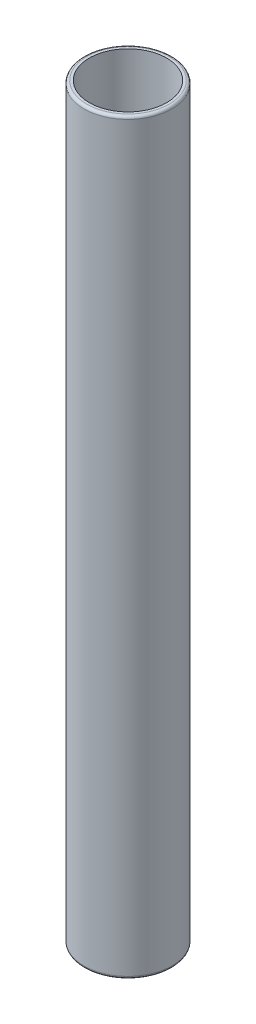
from build123d import *

# Parameters (mm, degrees)
SKETCH1_R           = 3.175
SKETCH1_R_2         = 2.794
BOSS_EXTRUDE1_DEPTH = 53.975
FILLET1_R           = 0.1984375


with BuildPart() as part:
    # Sketch1 → Boss-Extrude1 (new body)
    with BuildSketch(Plane(origin=(0, 0, 0), x_dir=(1, 0, 0), z_dir=(0, 1, 0))):
        with Locations(Location((0, 0, 0), (0, 0, 270))):
            Circle(SKETCH1_R)
        with Locations(Location((0, 0, 0), (0, 0, 270))):
            Circle(SKETCH1_R_2, mode=Mode.SUBTRACT)
    extrude(amount=BOSS_EXTRUDE1_DEPTH)

    # Fillet1
    fillet1_edges = [part.edges().sort_by_distance(p)[0] for p in [
        (0, 0, -3.175),
        (0, 53.975, -3.175),
    ]]
    fillet(fillet1_edges, radius=FILLET1_R)


solid = part.part
